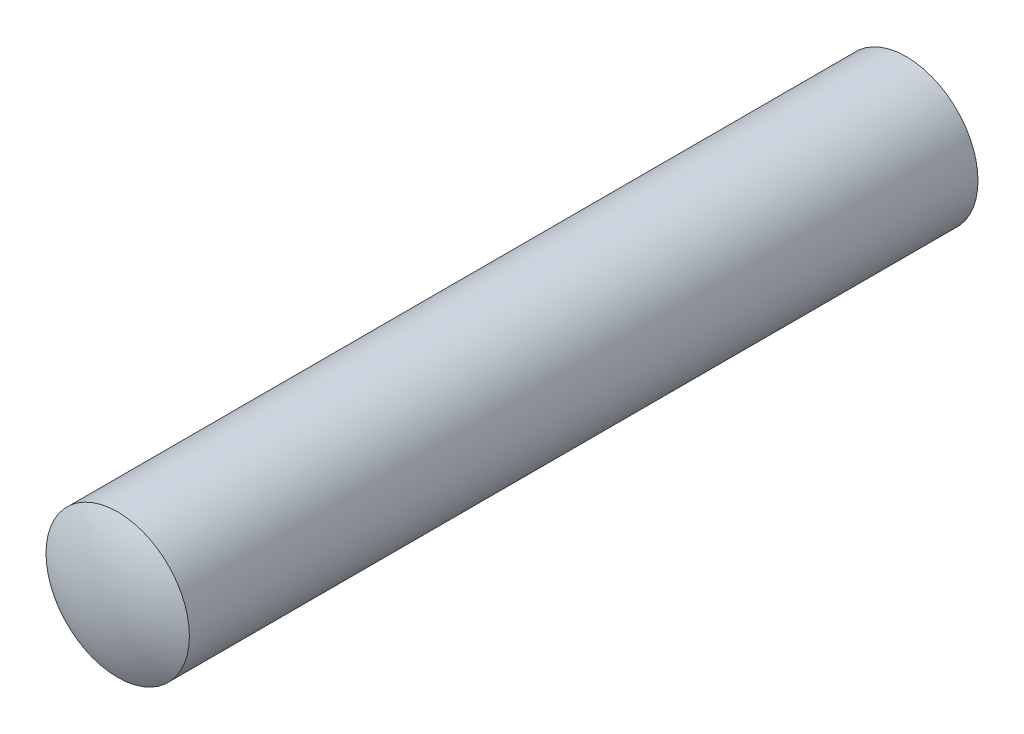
from build123d import *

# Parameters (mm, degrees)
ESQUISSE1_R      = 2
EXTRUSION1_DEPTH = 22


with BuildPart() as part:
    # Esquisse1 → Extrusion1 (new body)
    with BuildSketch(Plane.XY):
        Circle(ESQUISSE1_R)
    extrude(amount=EXTRUSION1_DEPTH)

    # Esquisse2 → R_volution1 (revolve)
    with BuildSketch(Plane(origin=(0, 0, 0), x_dir=(1, 0, 0), z_dir=(0, 1, 0))):
        with BuildLine():
            Line((0, 0.5), (0, 0))
            Line((0, 0), (-2, 0))
            ThreePointArc((-2, 0), (-1.030776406, 0.373105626), (0, 0.5))
        make_face()
    r_volution1 = revolve(axis=Axis((0, 0, 0), (0, 0, -1)))

    # Sym_trie1: R_volution1 across plane
    add(r_volution1.mirror(Plane.XY.offset(11)))


solid = part.part
